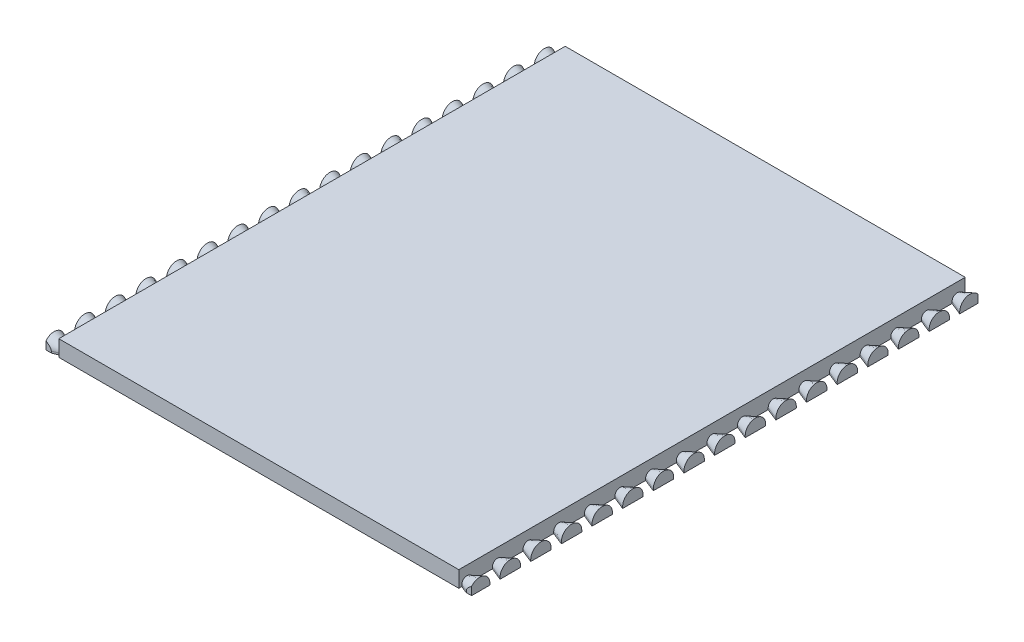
from build123d import *

# Parameters (mm, degrees)
CROQUIS1_W               = 500
CROQUIS1_H               = 19
EXTRUIR1_DEPTH           = 297.5
CORTAR_EXTRUIR1_DEPTH    = 2
CORTAR_REVOLUCI_N1_ANGLE = 180
CORTAR_EXTRUIR2_DEPTH    = 646.45739596
CORTAR_EXTRUIR3_DEPTH    = 389.966900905
CORTAR_REVOLUCI_N2_ANGLE = 180
CORTAR_EXTRUIR4_DEPTH    = 646.45739596
MATRIZL4_COUNT           = 9
MATRIZL4_PITCH           = 36
MATRIZL4_COPY_1_DEPTH    = 2
MATRIZL4_COPY_2_DEPTH    = 2
MATRIZL4_COPY_3_DEPTH    = 2
MATRIZL4_COPY_4_DEPTH    = 2
MATRIZL4_COPY_5_DEPTH    = 2
MATRIZL4_COPY_6_DEPTH    = 2
MATRIZL4_COPY_7_DEPTH    = 2
MATRIZL4_COPY_8_DEPTH    = 2
SIMETR_A9_COPY_1_DEPTH   = 2
SIMETR_A9_COPY_2_DEPTH   = 2
SIMETR_A9_COPY_3_DEPTH   = 2
SIMETR_A9_COPY_4_DEPTH   = 2
SIMETR_A9_COPY_5_DEPTH   = 2
SIMETR_A9_COPY_6_DEPTH   = 2
SIMETR_A9_COPY_7_DEPTH   = 2
SIMETR_A9_COPY_8_DEPTH   = 2
SIMETR_A9_COPY_9_DEPTH   = 2
SIMETR_A9_COPY_10_DEPTH  = 2
SIMETR_A9_COPY_11_ANGLE  = 180
SIMETR_A9_COPY_12_ANGLE  = 180
SIMETR_A9_COPY_13_ANGLE  = 180
SIMETR_A9_COPY_14_ANGLE  = 180
SIMETR_A9_COPY_15_ANGLE  = 180
SIMETR_A9_COPY_16_ANGLE  = 180
SIMETR_A9_COPY_17_ANGLE  = 180
SIMETR_A9_COPY_18_ANGLE  = 180
SIMETR_A9_COPY_19_ANGLE  = 180
SIMETR_A9_COPY_20_ANGLE  = 180
SIMETR_A9_COPY_21_ANGLE  = 180
SIMETR_A9_COPY_22_ANGLE  = 180
SIMETR_A9_COPY_23_ANGLE  = 180
SIMETR_A9_COPY_24_ANGLE  = 180
SIMETR_A9_COPY_25_ANGLE  = 180
SIMETR_A9_COPY_26_ANGLE  = 180
SIMETR_A9_COPY_27_DEPTH  = 2
SIMETR_A9_COPY_28_DEPTH  = 2
SIMETR_A9_COPY_29_DEPTH  = 2
SIMETR_A9_COPY_30_DEPTH  = 2
SIMETR_A9_COPY_31_DEPTH  = 2
SIMETR_A9_COPY_32_DEPTH  = 2
SIMETR_A9_COPY_33_DEPTH  = 2
SIMETR_A9_COPY_34_DEPTH  = 2
SIMETR_A9_COPY_35_DEPTH  = 2
SIMETR_A9_COPY_36_ANGLE  = 180
SIMETR_A9_COPY_37_ANGLE  = 180


with BuildPart() as part:
    # Croquis1 → Extruir1 (new, symmetric)
    with BuildSketch(Plane.XY):
        Rectangle(CROQUIS1_W, CROQUIS1_H)
    extrude(amount=EXTRUIR1_DEPTH, both=True)

    # Croquis2 → Cortar-Extruir1 (cut)
    with BuildSketch(Plane.XZ.offset(9.5)):
        Polygon((-250, 12), (-250, 24), (-235, 30), (-235, 6), align=None)
    cortar_extruir1 = extrude(amount=-CORTAR_EXTRUIR1_DEPTH, mode=Mode.SUBTRACT)

    # Croquis3 → Cortar-Revoluci_n1 (revolve, cut)
    with BuildSketch(Plane.XZ.offset(7.5)):
        Polygon((-250, 12), (-235, 6), (-235, 30), (-250, 24), align=None)
    cortar_revoluci_n1 = revolve(axis=Axis((0, -7.5, 0), (-1, 0, 0)), revolution_arc=CORTAR_REVOLUCI_N1_ANGLE, mode=Mode.SUBTRACT)

    # Croquis4 → Cortar-Extruir2 (cut, through all)
    with BuildSketch(Plane(origin=(0, 0, -297.5), x_dir=(-1, 0, 0), z_dir=(0, 0, -1))):
        Polygon((250, 4.5), (235, -1.5), (235, 9.5), (250, 9.5), align=None)
    extrude(amount=-CORTAR_EXTRUIR2_DEPTH, mode=Mode.SUBTRACT)

    # Croquis5 → Cortar-Extruir3 (cut, through all)
    with BuildSketch(Plane(origin=(0, -7.5, 0), x_dir=(1, 0, 0), z_dir=(0, 1, 0))):
        Polygon((-250, 24), (-250, 12), (-235, 6), (-235, 30), align=None)
    extrude(amount=-CORTAR_EXTRUIR3_DEPTH, mode=Mode.SUBTRACT)

    # Simetr_a10: Cortar-Extruir1 across plane
    add(cortar_extruir1.mirror(Plane(origin=(0, 0, 0), x_dir=(0, 0, 1), z_dir=(1, 0, 0))), mode=Mode.SUBTRACT)

    # Croquis6 → Cortar-Revoluci_n2 (revolve, cut)
    with BuildSketch(Plane.XZ.offset(7.5)):
        Polygon((235, 6), (250, 12), (250, 24), (235, 30), align=None)
    cortar_revoluci_n2 = revolve(axis=Axis((0, -7.5, 0), (-1, 0, 0)), revolution_arc=CORTAR_REVOLUCI_N2_ANGLE, mode=Mode.SUBTRACT)

    # Croquis7 → Cortar-Extruir4 (cut, through all)
    with BuildSketch(Plane.XY.offset(297.5)):
        Polygon((235, -1.5), (250, 4.5), (250, 9.5), (235, 9.5), align=None)
    extrude(amount=-CORTAR_EXTRUIR4_DEPTH, mode=Mode.SUBTRACT)

    # MatrizL4: Cortar-Extruir1, Cortar-Revoluci_n1, Cortar-Revoluci_n2 ×9
    with Locations(*[(0, 0, i * MATRIZL4_PITCH) for i in range(1, MATRIZL4_COUNT)]):
        add(cortar_extruir1, mode=Mode.SUBTRACT)
        add(cortar_revoluci_n1, mode=Mode.SUBTRACT)
        add(cortar_revoluci_n2, mode=Mode.SUBTRACT)

    # MatrizL4 copy 1 sketch → MatrizL4 copy 1 (cut)
    with BuildSketch(Plane(origin=(0, -9.5, 36), x_dir=(-1, 0, 0), z_dir=(0, -1, 0))):
        Polygon((-250, -12), (-250, -24), (-235, -30), (-235, -6), align=None)
    extrude(amount=-MATRIZL4_COPY_1_DEPTH, mode=Mode.SUBTRACT)

    # MatrizL4 copy 2 sketch → MatrizL4 copy 2 (cut)
    with BuildSketch(Plane(origin=(0, -9.5, 72), x_dir=(-1, 0, 0), z_dir=(0, -1, 0))):
        Polygon((-250, -12), (-250, -24), (-235, -30), (-235, -6), align=None)
    extrude(amount=-MATRIZL4_COPY_2_DEPTH, mode=Mode.SUBTRACT)

    # MatrizL4 copy 3 sketch → MatrizL4 copy 3 (cut)
    with BuildSketch(Plane(origin=(0, -9.5, 108), x_dir=(-1, 0, 0), z_dir=(0, -1, 0))):
        Polygon((-250, -12), (-250, -24), (-235, -30), (-235, -6), align=None)
    extrude(amount=-MATRIZL4_COPY_3_DEPTH, mode=Mode.SUBTRACT)

    # MatrizL4 copy 4 sketch → MatrizL4 copy 4 (cut)
    with BuildSketch(Plane(origin=(0, -9.5, 144), x_dir=(-1, 0, 0), z_dir=(0, -1, 0))):
        Polygon((-250, -12), (-250, -24), (-235, -30), (-235, -6), align=None)
    extrude(amount=-MATRIZL4_COPY_4_DEPTH, mode=Mode.SUBTRACT)

    # MatrizL4 copy 5 sketch → MatrizL4 copy 5 (cut)
    with BuildSketch(Plane(origin=(0, -9.5, 180), x_dir=(-1, 0, 0), z_dir=(0, -1, 0))):
        Polygon((-250, -12), (-250, -24), (-235, -30), (-235, -6), align=None)
    extrude(amount=-MATRIZL4_COPY_5_DEPTH, mode=Mode.SUBTRACT)

    # MatrizL4 copy 6 sketch → MatrizL4 copy 6 (cut)
    with BuildSketch(Plane(origin=(0, -9.5, 216), x_dir=(-1, 0, 0), z_dir=(0, -1, 0))):
        Polygon((-250, -12), (-250, -24), (-235, -30), (-235, -6), align=None)
    extrude(amount=-MATRIZL4_COPY_6_DEPTH, mode=Mode.SUBTRACT)

    # MatrizL4 copy 7 sketch → MatrizL4 copy 7 (cut)
    with BuildSketch(Plane(origin=(0, -9.5, 252), x_dir=(-1, 0, 0), z_dir=(0, -1, 0))):
        Polygon((-250, -12), (-250, -24), (-235, -30), (-235, -6), align=None)
    extrude(amount=-MATRIZL4_COPY_7_DEPTH, mode=Mode.SUBTRACT)

    # MatrizL4 copy 8 sketch → MatrizL4 copy 8 (cut)
    with BuildSketch(Plane(origin=(0, -9.5, 288), x_dir=(-1, 0, 0), z_dir=(0, -1, 0))):
        Polygon((-250, -12), (-250, -24), (-235, -30), (-235, -6), align=None)
    extrude(amount=-MATRIZL4_COPY_8_DEPTH, mode=Mode.SUBTRACT)

    # Simetr_a9 copy 1 sketch → Simetr_a9 copy 1 (cut)
    with BuildSketch(Plane(origin=(0, -9.5, 0), x_dir=(-1, 0, 0), z_dir=(0, -1, 0))):
        Polygon((-250, 12), (-250, 24), (-235, 30), (-235, 6), align=None)
    extrude(amount=-SIMETR_A9_COPY_1_DEPTH, mode=Mode.SUBTRACT)

    # Simetr_a9 copy 2 sketch → Simetr_a9 copy 2 (cut)
    with BuildSketch(Plane.XZ.offset(9.5)):
        Polygon((-250, -12), (-250, -24), (-235, -30), (-235, -6), align=None)
    extrude(amount=-SIMETR_A9_COPY_2_DEPTH, mode=Mode.SUBTRACT)

    # Simetr_a9 copy 3 sketch → Simetr_a9 copy 3 (cut)
    with BuildSketch(Plane(origin=(0, -9.5, -36), x_dir=(1, 0, 0), z_dir=(0, -1, 0))):
        Polygon((-250, -12), (-250, -24), (-235, -30), (-235, -6), align=None)
    extrude(amount=-SIMETR_A9_COPY_3_DEPTH, mode=Mode.SUBTRACT)

    # Simetr_a9 copy 4 sketch → Simetr_a9 copy 4 (cut)
    with BuildSketch(Plane(origin=(0, -9.5, -72), x_dir=(1, 0, 0), z_dir=(0, -1, 0))):
        Polygon((-250, -12), (-250, -24), (-235, -30), (-235, -6), align=None)
    extrude(amount=-SIMETR_A9_COPY_4_DEPTH, mode=Mode.SUBTRACT)

    # Simetr_a9 copy 5 sketch → Simetr_a9 copy 5 (cut)
    with BuildSketch(Plane(origin=(0, -9.5, -108), x_dir=(1, 0, 0), z_dir=(0, -1, 0))):
        Polygon((-250, -12), (-250, -24), (-235, -30), (-235, -6), align=None)
    extrude(amount=-SIMETR_A9_COPY_5_DEPTH, mode=Mode.SUBTRACT)

    # Simetr_a9 copy 6 sketch → Simetr_a9 copy 6 (cut)
    with BuildSketch(Plane(origin=(0, -9.5, -144), x_dir=(1, 0, 0), z_dir=(0, -1, 0))):
        Polygon((-250, -12), (-250, -24), (-235, -30), (-235, -6), align=None)
    extrude(amount=-SIMETR_A9_COPY_6_DEPTH, mode=Mode.SUBTRACT)

    # Simetr_a9 copy 7 sketch → Simetr_a9 copy 7 (cut)
    with BuildSketch(Plane(origin=(0, -9.5, -180), x_dir=(1, 0, 0), z_dir=(0, -1, 0))):
        Polygon((-250, -12), (-250, -24), (-235, -30), (-235, -6), align=None)
    extrude(amount=-SIMETR_A9_COPY_7_DEPTH, mode=Mode.SUBTRACT)

    # Simetr_a9 copy 8 sketch → Simetr_a9 copy 8 (cut)
    with BuildSketch(Plane(origin=(0, -9.5, -216), x_dir=(1, 0, 0), z_dir=(0, -1, 0))):
        Polygon((-250, -12), (-250, -24), (-235, -30), (-235, -6), align=None)
    extrude(amount=-SIMETR_A9_COPY_8_DEPTH, mode=Mode.SUBTRACT)

    # Simetr_a9 copy 9 sketch → Simetr_a9 copy 9 (cut)
    with BuildSketch(Plane(origin=(0, -9.5, -252), x_dir=(1, 0, 0), z_dir=(0, -1, 0))):
        Polygon((-250, -12), (-250, -24), (-235, -30), (-235, -6), align=None)
    extrude(amount=-SIMETR_A9_COPY_9_DEPTH, mode=Mode.SUBTRACT)

    # Simetr_a9 copy 10 sketch → Simetr_a9 copy 10 (cut)
    with BuildSketch(Plane(origin=(0, -9.5, -288), x_dir=(1, 0, 0), z_dir=(0, -1, 0))):
        Polygon((-250, -12), (-250, -24), (-235, -30), (-235, -6), align=None)
    extrude(amount=-SIMETR_A9_COPY_10_DEPTH, mode=Mode.SUBTRACT)

    # Simetr_a9 copy 11 sketch → Simetr_a9 copy 11 (revolve, cut)
    with BuildSketch(Plane(origin=(0, -7.5, -36), x_dir=(1, 0, 0), z_dir=(0, -1, 0))):
        Polygon((-250, -12), (-235, -6), (-235, -30), (-250, -24), align=None)
    revolve(axis=Axis((0, -7.5, -36), (1, 0, 0)), revolution_arc=SIMETR_A9_COPY_11_ANGLE, mode=Mode.SUBTRACT)

    # Simetr_a9 copy 12 sketch → Simetr_a9 copy 12 (revolve, cut)
    with BuildSketch(Plane(origin=(0, -7.5, -72), x_dir=(1, 0, 0), z_dir=(0, -1, 0))):
        Polygon((-250, -12), (-235, -6), (-235, -30), (-250, -24), align=None)
    revolve(axis=Axis((0, -7.5, -72), (1, 0, 0)), revolution_arc=SIMETR_A9_COPY_12_ANGLE, mode=Mode.SUBTRACT)

    # Simetr_a9 copy 13 sketch → Simetr_a9 copy 13 (revolve, cut)
    with BuildSketch(Plane(origin=(0, -7.5, -108), x_dir=(1, 0, 0), z_dir=(0, -1, 0))):
        Polygon((-250, -12), (-235, -6), (-235, -30), (-250, -24), align=None)
    revolve(axis=Axis((0, -7.5, -108), (1, 0, 0)), revolution_arc=SIMETR_A9_COPY_13_ANGLE, mode=Mode.SUBTRACT)

    # Simetr_a9 copy 14 sketch → Simetr_a9 copy 14 (revolve, cut)
    with BuildSketch(Plane(origin=(0, -7.5, -144), x_dir=(1, 0, 0), z_dir=(0, -1, 0))):
        Polygon((-250, -12), (-235, -6), (-235, -30), (-250, -24), align=None)
    revolve(axis=Axis((0, -7.5, -144), (1, 0, 0)), revolution_arc=SIMETR_A9_COPY_14_ANGLE, mode=Mode.SUBTRACT)

    # Simetr_a9 copy 15 sketch → Simetr_a9 copy 15 (revolve, cut)
    with BuildSketch(Plane(origin=(0, -7.5, -180), x_dir=(1, 0, 0), z_dir=(0, -1, 0))):
        Polygon((-250, -12), (-235, -6), (-235, -30), (-250, -24), align=None)
    revolve(axis=Axis((0, -7.5, -180), (1, 0, 0)), revolution_arc=SIMETR_A9_COPY_15_ANGLE, mode=Mode.SUBTRACT)

    # Simetr_a9 copy 16 sketch → Simetr_a9 copy 16 (revolve, cut)
    with BuildSketch(Plane(origin=(0, -7.5, -216), x_dir=(1, 0, 0), z_dir=(0, -1, 0))):
        Polygon((-250, -12), (-235, -6), (-235, -30), (-250, -24), align=None)
    revolve(axis=Axis((0, -7.5, -216), (1, 0, 0)), revolution_arc=SIMETR_A9_COPY_16_ANGLE, mode=Mode.SUBTRACT)

    # Simetr_a9 copy 17 sketch → Simetr_a9 copy 17 (revolve, cut)
    with BuildSketch(Plane(origin=(0, -7.5, -252), x_dir=(1, 0, 0), z_dir=(0, -1, 0))):
        Polygon((-250, -12), (-235, -6), (-235, -30), (-250, -24), align=None)
    revolve(axis=Axis((0, -7.5, -252), (1, 0, 0)), revolution_arc=SIMETR_A9_COPY_17_ANGLE, mode=Mode.SUBTRACT)

    # Simetr_a9 copy 18 sketch → Simetr_a9 copy 18 (revolve, cut)
    with BuildSketch(Plane(origin=(0, -7.5, -288), x_dir=(1, 0, 0), z_dir=(0, -1, 0))):
        Polygon((-250, -12), (-235, -6), (-235, -30), (-250, -24), align=None)
    revolve(axis=Axis((0, -7.5, -288), (1, 0, 0)), revolution_arc=SIMETR_A9_COPY_18_ANGLE, mode=Mode.SUBTRACT)

    # Simetr_a9 copy 19 sketch → Simetr_a9 copy 19 (revolve, cut)
    with BuildSketch(Plane(origin=(0, -7.5, -36), x_dir=(1, 0, 0), z_dir=(0, -1, 0))):
        Polygon((235, -6), (250, -12), (250, -24), (235, -30), align=None)
    revolve(axis=Axis((0, -7.5, -36), (1, 0, 0)), revolution_arc=SIMETR_A9_COPY_19_ANGLE, mode=Mode.SUBTRACT)

    # Simetr_a9 copy 20 sketch → Simetr_a9 copy 20 (revolve, cut)
    with BuildSketch(Plane(origin=(0, -7.5, -72), x_dir=(1, 0, 0), z_dir=(0, -1, 0))):
        Polygon((235, -6), (250, -12), (250, -24), (235, -30), align=None)
    revolve(axis=Axis((0, -7.5, -72), (1, 0, 0)), revolution_arc=SIMETR_A9_COPY_20_ANGLE, mode=Mode.SUBTRACT)

    # Simetr_a9 copy 21 sketch → Simetr_a9 copy 21 (revolve, cut)
    with BuildSketch(Plane(origin=(0, -7.5, -108), x_dir=(1, 0, 0), z_dir=(0, -1, 0))):
        Polygon((235, -6), (250, -12), (250, -24), (235, -30), align=None)
    revolve(axis=Axis((0, -7.5, -108), (1, 0, 0)), revolution_arc=SIMETR_A9_COPY_21_ANGLE, mode=Mode.SUBTRACT)

    # Simetr_a9 copy 22 sketch → Simetr_a9 copy 22 (revolve, cut)
    with BuildSketch(Plane(origin=(0, -7.5, -144), x_dir=(1, 0, 0), z_dir=(0, -1, 0))):
        Polygon((235, -6), (250, -12), (250, -24), (235, -30), align=None)
    revolve(axis=Axis((0, -7.5, -144), (1, 0, 0)), revolution_arc=SIMETR_A9_COPY_22_ANGLE, mode=Mode.SUBTRACT)

    # Simetr_a9 copy 23 sketch → Simetr_a9 copy 23 (revolve, cut)
    with BuildSketch(Plane(origin=(0, -7.5, -180), x_dir=(1, 0, 0), z_dir=(0, -1, 0))):
        Polygon((235, -6), (250, -12), (250, -24), (235, -30), align=None)
    revolve(axis=Axis((0, -7.5, -180), (1, 0, 0)), revolution_arc=SIMETR_A9_COPY_23_ANGLE, mode=Mode.SUBTRACT)

    # Simetr_a9 copy 24 sketch → Simetr_a9 copy 24 (revolve, cut)
    with BuildSketch(Plane(origin=(0, -7.5, -216), x_dir=(1, 0, 0), z_dir=(0, -1, 0))):
        Polygon((235, -6), (250, -12), (250, -24), (235, -30), align=None)
    revolve(axis=Axis((0, -7.5, -216), (1, 0, 0)), revolution_arc=SIMETR_A9_COPY_24_ANGLE, mode=Mode.SUBTRACT)

    # Simetr_a9 copy 25 sketch → Simetr_a9 copy 25 (revolve, cut)
    with BuildSketch(Plane(origin=(0, -7.5, -252), x_dir=(1, 0, 0), z_dir=(0, -1, 0))):
        Polygon((235, -6), (250, -12), (250, -24), (235, -30), align=None)
    revolve(axis=Axis((0, -7.5, -252), (1, 0, 0)), revolution_arc=SIMETR_A9_COPY_25_ANGLE, mode=Mode.SUBTRACT)

    # Simetr_a9 copy 26 sketch → Simetr_a9 copy 26 (revolve, cut)
    with BuildSketch(Plane(origin=(0, -7.5, -288), x_dir=(1, 0, 0), z_dir=(0, -1, 0))):
        Polygon((235, -6), (250, -12), (250, -24), (235, -30), align=None)
    revolve(axis=Axis((0, -7.5, -288), (1, 0, 0)), revolution_arc=SIMETR_A9_COPY_26_ANGLE, mode=Mode.SUBTRACT)

    # Simetr_a9 copy 27 sketch → Simetr_a9 copy 27 (cut)
    with BuildSketch(Plane(origin=(0, -9.5, -36), x_dir=(-1, 0, 0), z_dir=(0, -1, 0))):
        Polygon((-250, 12), (-250, 24), (-235, 30), (-235, 6), align=None)
    extrude(amount=-SIMETR_A9_COPY_27_DEPTH, mode=Mode.SUBTRACT)

    # Simetr_a9 copy 28 sketch → Simetr_a9 copy 28 (cut)
    with BuildSketch(Plane(origin=(0, -9.5, -72), x_dir=(-1, 0, 0), z_dir=(0, -1, 0))):
        Polygon((-250, 12), (-250, 24), (-235, 30), (-235, 6), align=None)
    extrude(amount=-SIMETR_A9_COPY_28_DEPTH, mode=Mode.SUBTRACT)

    # Simetr_a9 copy 29 sketch → Simetr_a9 copy 29 (cut)
    with BuildSketch(Plane(origin=(0, -9.5, -108), x_dir=(-1, 0, 0), z_dir=(0, -1, 0))):
        Polygon((-250, 12), (-250, 24), (-235, 30), (-235, 6), align=None)
    extrude(amount=-SIMETR_A9_COPY_29_DEPTH, mode=Mode.SUBTRACT)

    # Simetr_a9 copy 30 sketch → Simetr_a9 copy 30 (cut)
    with BuildSketch(Plane(origin=(0, -9.5, -144), x_dir=(-1, 0, 0), z_dir=(0, -1, 0))):
        Polygon((-250, 12), (-250, 24), (-235, 30), (-235, 6), align=None)
    extrude(amount=-SIMETR_A9_COPY_30_DEPTH, mode=Mode.SUBTRACT)

    # Simetr_a9 copy 31 sketch → Simetr_a9 copy 31 (cut)
    with BuildSketch(Plane(origin=(0, -9.5, -180), x_dir=(-1, 0, 0), z_dir=(0, -1, 0))):
        Polygon((-250, 12), (-250, 24), (-235, 30), (-235, 6), align=None)
    extrude(amount=-SIMETR_A9_COPY_31_DEPTH, mode=Mode.SUBTRACT)

    # Simetr_a9 copy 32 sketch → Simetr_a9 copy 32 (cut)
    with BuildSketch(Plane(origin=(0, -9.5, -216), x_dir=(-1, 0, 0), z_dir=(0, -1, 0))):
        Polygon((-250, 12), (-250, 24), (-235, 30), (-235, 6), align=None)
    extrude(amount=-SIMETR_A9_COPY_32_DEPTH, mode=Mode.SUBTRACT)

    # Simetr_a9 copy 33 sketch → Simetr_a9 copy 33 (cut)
    with BuildSketch(Plane(origin=(0, -9.5, -252), x_dir=(-1, 0, 0), z_dir=(0, -1, 0))):
        Polygon((-250, 12), (-250, 24), (-235, 30), (-235, 6), align=None)
    extrude(amount=-SIMETR_A9_COPY_33_DEPTH, mode=Mode.SUBTRACT)

    # Simetr_a9 copy 34 sketch → Simetr_a9 copy 34 (cut)
    with BuildSketch(Plane(origin=(0, -9.5, -288), x_dir=(-1, 0, 0), z_dir=(0, -1, 0))):
        Polygon((-250, 12), (-250, 24), (-235, 30), (-235, 6), align=None)
    extrude(amount=-SIMETR_A9_COPY_34_DEPTH, mode=Mode.SUBTRACT)

    # Simetr_a9 copy 35 sketch → Simetr_a9 copy 35 (cut)
    with BuildSketch(Plane.XZ.offset(9.5)):
        Polygon((-250, -12), (-250, -24), (-235, -30), (-235, -6), align=None)
    extrude(amount=-SIMETR_A9_COPY_35_DEPTH, mode=Mode.SUBTRACT)

    # Simetr_a9 copy 36 sketch → Simetr_a9 copy 36 (revolve, cut)
    with BuildSketch(Plane.XZ.offset(7.5)):
        Polygon((-250, -12), (-235, -6), (-235, -30), (-250, -24), align=None)
    revolve(axis=Axis((0, -7.5, 0), (1, 0, 0)), revolution_arc=SIMETR_A9_COPY_36_ANGLE, mode=Mode.SUBTRACT)

    # Simetr_a9 copy 37 sketch → Simetr_a9 copy 37 (revolve, cut)
    with BuildSketch(Plane.XZ.offset(7.5)):
        Polygon((235, -6), (250, -12), (250, -24), (235, -30), align=None)
    revolve(axis=Axis((0, -7.5, 0), (1, 0, 0)), revolution_arc=SIMETR_A9_COPY_37_ANGLE, mode=Mode.SUBTRACT)


solid = part.part
